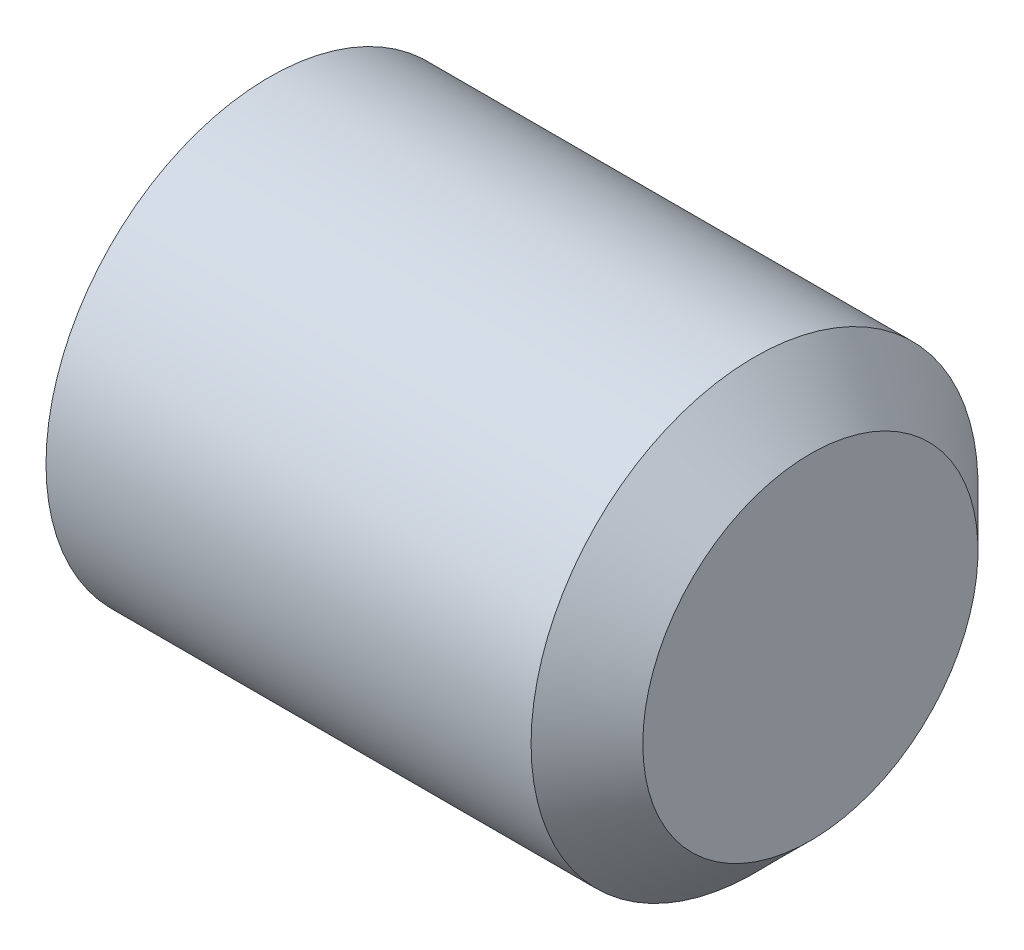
ISO-10303-21;
HEADER;
FILE_DESCRIPTION(('STEP AP214'),'2;1');
FILE_NAME('part.step','',(''),(''),'','','');
FILE_SCHEMA(('AUTOMOTIVE_DESIGN { 1 0 10303 214 1 1 1 1 }'));
ENDSEC;
DATA;
#1=APPLICATION_CONTEXT('core data for automotive mechanical design processes');
#2=APPLICATION_PROTOCOL_DEFINITION('international standard','automotive_design',2000,#1);
#3=PRODUCT_CONTEXT('',#1,'mechanical');
#4=PRODUCT('Part','Part','',(#3));
#5=PRODUCT_RELATED_PRODUCT_CATEGORY('part','',(#4));
#6=PRODUCT_DEFINITION_FORMATION('','',#4);
#7=PRODUCT_DEFINITION_CONTEXT('part definition',#1,'design');
#8=PRODUCT_DEFINITION('design','',#6,#7);
#9=PRODUCT_DEFINITION_SHAPE('','',#8);
#10=(LENGTH_UNIT() NAMED_UNIT(*) SI_UNIT(.MILLI.,.METRE.));
#11=(NAMED_UNIT(*) PLANE_ANGLE_UNIT() SI_UNIT($,.RADIAN.));
#12=(NAMED_UNIT(*) SI_UNIT($,.STERADIAN.) SOLID_ANGLE_UNIT());
#13=UNCERTAINTY_MEASURE_WITH_UNIT(LENGTH_MEASURE(1.E-05),#10,'distance_accuracy_value','');
#14=(GEOMETRIC_REPRESENTATION_CONTEXT(3) GLOBAL_UNCERTAINTY_ASSIGNED_CONTEXT((#13)) GLOBAL_UNIT_ASSIGNED_CONTEXT((#10,
#11,#12)) REPRESENTATION_CONTEXT('',''));
#15=CARTESIAN_POINT('',(0.,0.,0.));
#16=DIRECTION('',(0.,0.,1.));
#17=DIRECTION('',(1.,0.,0.));
#18=AXIS2_PLACEMENT_3D('',#15,#16,#17);
#19=CARTESIAN_POINT('',(0.,0.,0.));
#20=DIRECTION('',(-1.,0.,0.));
#21=DIRECTION('',(0.,0.,1.));
#22=AXIS2_PLACEMENT_3D('',#19,#20,#21);
#23=PLANE('',#22);
#24=CARTESIAN_POINT('',(0.,0.,0.));
#25=DIRECTION('',(-1.,0.,0.));
#26=DIRECTION('',(0.,0.,1.));
#27=AXIS2_PLACEMENT_3D('',#24,#25,#26);
#28=CIRCLE('',#27,10.352);
#29=CARTESIAN_POINT('',(0.,0.,10.352));
#30=VERTEX_POINT('',#29);
#31=EDGE_CURVE('E10',#30,#30,#28,.T.);
#32=ORIENTED_EDGE('',*,*,#31,.T.);
#33=EDGE_LOOP('',(#32));
#34=FACE_BOUND('',#33,.T.);
#35=ADVANCED_FACE('F43',(#34),#23,.T.);
#36=CARTESIAN_POINT('',(0.,0.,0.));
#37=DIRECTION('',(1.,0.,0.));
#38=DIRECTION('',(0.,0.,-1.));
#39=AXIS2_PLACEMENT_3D('',#36,#37,#38);
#40=CONICAL_SURFACE('',#39,10.352,1.04719755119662);
#41=CARTESIAN_POINT('',(0.951473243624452,0.,0.));
#42=DIRECTION('',(-1.,0.,0.));
#43=DIRECTION('',(0.,0.,1.));
#44=AXIS2_PLACEMENT_3D('',#41,#42,#43);
#45=CIRCLE('',#44,12.);
#46=CARTESIAN_POINT('',(0.951473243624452,0.,12.));
#47=VERTEX_POINT('',#46);
#48=EDGE_CURVE('E49',#47,#47,#45,.T.);
#49=ORIENTED_EDGE('',*,*,#48,.T.);
#50=EDGE_LOOP('',(#49));
#51=FACE_BOUND('',#50,.T.);
#52=ORIENTED_EDGE('',*,*,#31,.F.);
#53=EDGE_LOOP('',(#52));
#54=FACE_BOUND('',#53,.T.);
#55=ADVANCED_FACE('F76',(#51,#54),#40,.T.);
#56=CARTESIAN_POINT('',(-12.7,0.,0.));
#57=DIRECTION('',(-1.,0.,0.));
#58=DIRECTION('',(0.,0.,1.));
#59=AXIS2_PLACEMENT_3D('',#56,#57,#58);
#60=CYLINDRICAL_SURFACE('',#59,12.);
#61=CARTESIAN_POINT('',(27.,0.,0.));
#62=DIRECTION('',(-1.,0.,0.));
#63=DIRECTION('',(0.,0.,1.));
#64=AXIS2_PLACEMENT_3D('',#61,#62,#63);
#65=CIRCLE('',#64,12.);
#66=CARTESIAN_POINT('',(27.,0.,12.));
#67=VERTEX_POINT('',#66);
#68=EDGE_CURVE('E53',#67,#67,#65,.T.);
#69=ORIENTED_EDGE('',*,*,#68,.T.);
#70=EDGE_LOOP('',(#69));
#71=FACE_BOUND('',#70,.T.);
#72=ORIENTED_EDGE('',*,*,#48,.F.);
#73=EDGE_LOOP('',(#72));
#74=FACE_BOUND('',#73,.T.);
#75=ADVANCED_FACE('F73',(#71,#74),#60,.T.);
#76=CARTESIAN_POINT('',(27.,0.,0.));
#77=DIRECTION('',(-1.,0.,0.));
#78=DIRECTION('',(0.,0.,1.));
#79=AXIS2_PLACEMENT_3D('',#76,#77,#78);
#80=CONICAL_SURFACE('',#79,12.,0.785398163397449);
#81=CARTESIAN_POINT('',(30.,0.,0.));
#82=DIRECTION('',(-1.,0.,0.));
#83=DIRECTION('',(0.,0.,1.));
#84=AXIS2_PLACEMENT_3D('',#81,#82,#83);
#85=CIRCLE('',#84,9.);
#86=CARTESIAN_POINT('',(30.,0.,9.));
#87=VERTEX_POINT('',#86);
#88=EDGE_CURVE('E57',#87,#87,#85,.T.);
#89=ORIENTED_EDGE('',*,*,#88,.T.);
#90=EDGE_LOOP('',(#89));
#91=FACE_BOUND('',#90,.T.);
#92=ORIENTED_EDGE('',*,*,#68,.F.);
#93=EDGE_LOOP('',(#92));
#94=FACE_BOUND('',#93,.T.);
#95=ADVANCED_FACE('F63',(#91,#94),#80,.T.);
#96=CARTESIAN_POINT('',(30.,9.,0.));
#97=DIRECTION('',(1.,0.,0.));
#98=DIRECTION('',(0.,0.,-1.));
#99=AXIS2_PLACEMENT_3D('',#96,#97,#98);
#100=PLANE('',#99);
#101=ORIENTED_EDGE('',*,*,#88,.F.);
#102=EDGE_LOOP('',(#101));
#103=FACE_BOUND('',#102,.T.);
#104=ADVANCED_FACE('F66',(#103),#100,.T.);
#105=CLOSED_SHELL('',(#35,#55,#75,#95,#104));
#106=MANIFOLD_SOLID_BREP('B2',#105);
#107=ADVANCED_BREP_SHAPE_REPRESENTATION('',(#18,#106),#14);
#108=SHAPE_DEFINITION_REPRESENTATION(#9,#107);
ENDSEC;
END-ISO-10303-21;
